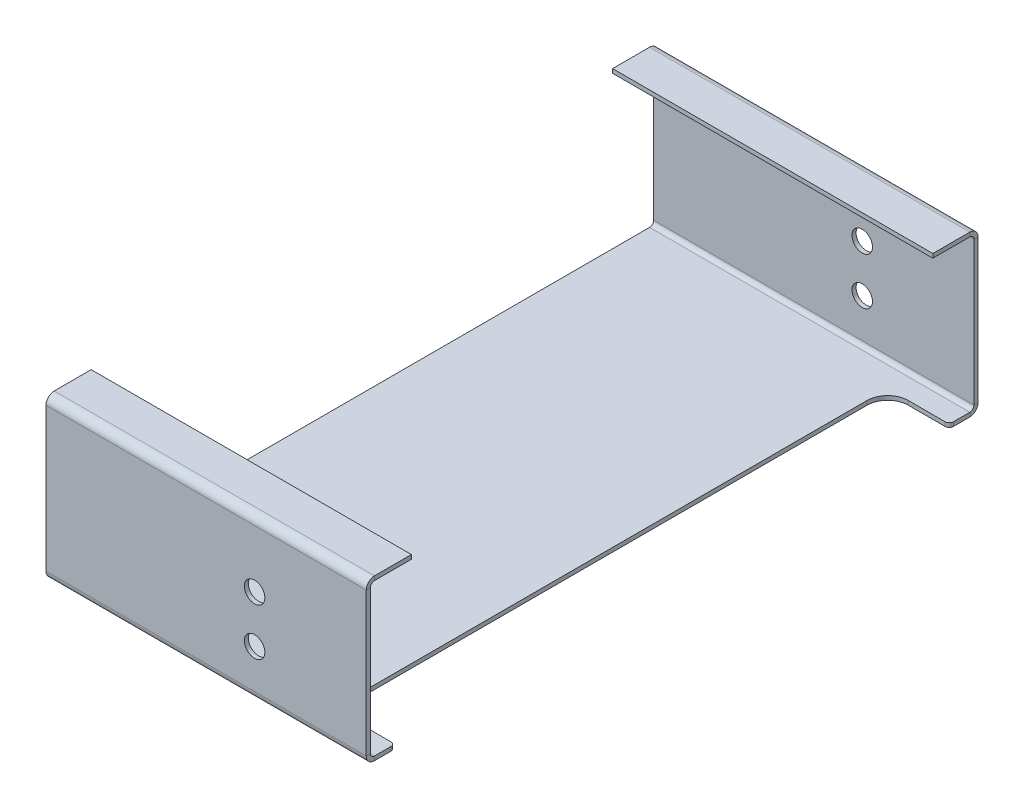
ISO-10303-21;
HEADER;
FILE_DESCRIPTION(('STEP AP214'),'2;1');
FILE_NAME('part.step','',(''),(''),'','','');
FILE_SCHEMA(('AUTOMOTIVE_DESIGN { 1 0 10303 214 1 1 1 1 }'));
ENDSEC;
DATA;
#1=APPLICATION_CONTEXT('core data for automotive mechanical design processes');
#2=APPLICATION_PROTOCOL_DEFINITION('international standard','automotive_design',2000,#1);
#3=PRODUCT_CONTEXT('',#1,'mechanical');
#4=PRODUCT('Part','Part','',(#3));
#5=PRODUCT_RELATED_PRODUCT_CATEGORY('part','',(#4));
#6=PRODUCT_DEFINITION_FORMATION('','',#4);
#7=PRODUCT_DEFINITION_CONTEXT('part definition',#1,'design');
#8=PRODUCT_DEFINITION('design','',#6,#7);
#9=PRODUCT_DEFINITION_SHAPE('','',#8);
#10=(LENGTH_UNIT() NAMED_UNIT(*) SI_UNIT(.MILLI.,.METRE.));
#11=(NAMED_UNIT(*) PLANE_ANGLE_UNIT() SI_UNIT($,.RADIAN.));
#12=(NAMED_UNIT(*) SI_UNIT($,.STERADIAN.) SOLID_ANGLE_UNIT());
#13=UNCERTAINTY_MEASURE_WITH_UNIT(LENGTH_MEASURE(1.E-05),#10,'distance_accuracy_value','');
#14=(GEOMETRIC_REPRESENTATION_CONTEXT(3) GLOBAL_UNCERTAINTY_ASSIGNED_CONTEXT((#13)) GLOBAL_UNIT_ASSIGNED_CONTEXT((#10,
#11,#12)) REPRESENTATION_CONTEXT('',''));
#15=CARTESIAN_POINT('',(0.,0.,0.));
#16=DIRECTION('',(0.,0.,1.));
#17=DIRECTION('',(1.,0.,0.));
#18=AXIS2_PLACEMENT_3D('',#15,#16,#17);
#19=CARTESIAN_POINT('',(0.,0.,147.));
#20=DIRECTION('',(1.,0.,0.));
#21=DIRECTION('',(0.,0.,-1.));
#22=AXIS2_PLACEMENT_3D('',#19,#20,#21);
#23=PLANE('',#22);
#24=DIRECTION('',(0.,0.,1.));
#25=VECTOR('',#24,1.);
#26=CARTESIAN_POINT('',(0.,-1.,147.));
#27=LINE('',#26,#25);
#28=CARTESIAN_POINT('',(0.,-1.,146.));
#29=VERTEX_POINT('',#28);
#30=CARTESIAN_POINT('',(0.,-1.,142.));
#31=VERTEX_POINT('',#30);
#32=EDGE_CURVE('E407',#29,#31,#27,.F.);
#33=ORIENTED_EDGE('',*,*,#32,.T.);
#34=DIRECTION('',(0.,1.,0.));
#35=VECTOR('',#34,1.);
#36=CARTESIAN_POINT('',(0.,0.,142.));
#37=LINE('',#36,#35);
#38=CARTESIAN_POINT('',(0.,0.,142.));
#39=VERTEX_POINT('',#38);
#40=EDGE_CURVE('E518',#31,#39,#37,.T.);
#41=ORIENTED_EDGE('',*,*,#40,.T.);
#42=DIRECTION('',(0.,0.,-1.));
#43=VECTOR('',#42,1.);
#44=CARTESIAN_POINT('',(0.,0.,147.));
#45=LINE('',#44,#43);
#46=CARTESIAN_POINT('',(0.,0.,146.));
#47=VERTEX_POINT('',#46);
#48=EDGE_CURVE('E436',#47,#39,#45,.T.);
#49=ORIENTED_EDGE('',*,*,#48,.F.);
#50=DIRECTION('',(0.,-1.,0.));
#51=VECTOR('',#50,1.);
#52=CARTESIAN_POINT('',(0.,0.,146.));
#53=LINE('',#52,#51);
#54=EDGE_CURVE('E492',#47,#29,#53,.T.);
#55=ORIENTED_EDGE('',*,*,#54,.T.);
#56=EDGE_LOOP('',(#33,#41,#49,#55));
#57=FACE_BOUND('',#56,.T.);
#58=ADVANCED_FACE('F86',(#57),#23,.T.);
#59=CARTESIAN_POINT('',(0.,0.,4.99999999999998));
#60=VERTEX_POINT('',#59);
#61=CARTESIAN_POINT('',(0.,0.,1.));
#62=VERTEX_POINT('',#61);
#63=EDGE_CURVE('E435',#60,#62,#45,.T.);
#64=ORIENTED_EDGE('',*,*,#63,.F.);
#65=DIRECTION('',(0.,1.,0.));
#66=VECTOR('',#65,1.);
#67=CARTESIAN_POINT('',(0.,-1.,4.99999999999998));
#68=LINE('',#67,#66);
#69=CARTESIAN_POINT('',(0.,-1.,4.99999999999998));
#70=VERTEX_POINT('',#69);
#71=EDGE_CURVE('E15',#60,#70,#68,.F.);
#72=ORIENTED_EDGE('',*,*,#71,.T.);
#73=CARTESIAN_POINT('',(0.,-1.,1.));
#74=VERTEX_POINT('',#73);
#75=EDGE_CURVE('E415',#70,#74,#27,.F.);
#76=ORIENTED_EDGE('',*,*,#75,.T.);
#77=DIRECTION('',(0.,-1.,0.));
#78=VECTOR('',#77,1.);
#79=CARTESIAN_POINT('',(0.,0.,1.));
#80=LINE('',#79,#78);
#81=EDGE_CURVE('E494',#62,#74,#80,.T.);
#82=ORIENTED_EDGE('',*,*,#81,.F.);
#83=EDGE_LOOP('',(#64,#72,#76,#82));
#84=FACE_BOUND('',#83,.T.);
#85=ADVANCED_FACE('F630',(#84),#23,.T.);
#86=CARTESIAN_POINT('',(0.,1.,146.));
#87=DIRECTION('',(1.,0.,0.));
#88=DIRECTION('',(0.,0.,-1.));
#89=AXIS2_PLACEMENT_3D('',#86,#87,#88);
#90=PLANE('',#89);
#91=ORIENTED_EDGE('',*,*,#54,.F.);
#92=CARTESIAN_POINT('',(0.,1.,146.));
#93=DIRECTION('',(-1.,0.,0.));
#94=DIRECTION('',(0.,0.,1.));
#95=AXIS2_PLACEMENT_3D('',#92,#93,#94);
#96=CIRCLE('',#95,1.);
#97=CARTESIAN_POINT('',(0.,1.,147.));
#98=VERTEX_POINT('',#97);
#99=EDGE_CURVE('E368',#47,#98,#96,.T.);
#100=ORIENTED_EDGE('',*,*,#99,.T.);
#101=DIRECTION('',(0.,0.,1.));
#102=VECTOR('',#101,1.);
#103=CARTESIAN_POINT('',(0.,1.,147.));
#104=LINE('',#103,#102);
#105=CARTESIAN_POINT('',(0.,1.,148.));
#106=VERTEX_POINT('',#105);
#107=EDGE_CURVE('E490',#98,#106,#104,.T.);
#108=ORIENTED_EDGE('',*,*,#107,.T.);
#109=CARTESIAN_POINT('',(0.,1.,146.));
#110=DIRECTION('',(-1.,0.,0.));
#111=DIRECTION('',(0.,0.,1.));
#112=AXIS2_PLACEMENT_3D('',#109,#110,#111);
#113=CIRCLE('',#112,2.);
#114=EDGE_CURVE('E411',#29,#106,#113,.T.);
#115=ORIENTED_EDGE('',*,*,#114,.F.);
#116=EDGE_LOOP('',(#91,#100,#108,#115));
#117=FACE_BOUND('',#116,.T.);
#118=ADVANCED_FACE('F610',(#117),#90,.T.);
#119=CARTESIAN_POINT('',(0.,0.,147.));
#120=DIRECTION('',(1.,0.,0.));
#121=DIRECTION('',(0.,1.,0.));
#122=AXIS2_PLACEMENT_3D('',#119,#120,#121);
#123=PLANE('',#122);
#124=ORIENTED_EDGE('',*,*,#107,.F.);
#125=DIRECTION('',(0.,1.,0.));
#126=VECTOR('',#125,1.);
#127=CARTESIAN_POINT('',(0.,0.,147.));
#128=LINE('',#127,#126);
#129=CARTESIAN_POINT('',(0.,36.,147.));
#130=VERTEX_POINT('',#129);
#131=EDGE_CURVE('E426',#98,#130,#128,.T.);
#132=ORIENTED_EDGE('',*,*,#131,.T.);
#133=DIRECTION('',(0.,0.,1.));
#134=VECTOR('',#133,1.);
#135=CARTESIAN_POINT('',(0.,36.,147.));
#136=LINE('',#135,#134);
#137=CARTESIAN_POINT('',(0.,36.,148.));
#138=VERTEX_POINT('',#137);
#139=EDGE_CURVE('E488',#130,#138,#136,.T.);
#140=ORIENTED_EDGE('',*,*,#139,.T.);
#141=DIRECTION('',(0.,1.,0.));
#142=VECTOR('',#141,1.);
#143=CARTESIAN_POINT('',(0.,0.,148.));
#144=LINE('',#143,#142);
#145=EDGE_CURVE('E403',#106,#138,#144,.T.);
#146=ORIENTED_EDGE('',*,*,#145,.F.);
#147=EDGE_LOOP('',(#124,#132,#140,#146));
#148=FACE_BOUND('',#147,.T.);
#149=ADVANCED_FACE('F587',(#148),#123,.T.);
#150=CARTESIAN_POINT('',(-78.,36.,147.));
#151=DIRECTION('',(-1.,0.,0.));
#152=DIRECTION('',(0.,-1.,0.));
#153=AXIS2_PLACEMENT_3D('',#150,#151,#152);
#154=PLANE('',#153);
#155=DIRECTION('',(0.,0.,1.));
#156=VECTOR('',#155,1.);
#157=CARTESIAN_POINT('',(-78.,36.,147.));
#158=LINE('',#157,#156);
#159=CARTESIAN_POINT('',(-78.,36.,147.));
#160=VERTEX_POINT('',#159);
#161=CARTESIAN_POINT('',(-78.,36.,148.));
#162=VERTEX_POINT('',#161);
#163=EDGE_CURVE('E485',#160,#162,#158,.T.);
#164=ORIENTED_EDGE('',*,*,#163,.F.);
#165=DIRECTION('',(0.,-1.,0.));
#166=VECTOR('',#165,1.);
#167=CARTESIAN_POINT('',(-78.,36.,147.));
#168=LINE('',#167,#166);
#169=CARTESIAN_POINT('',(-78.,1.,147.));
#170=VERTEX_POINT('',#169);
#171=EDGE_CURVE('E432',#160,#170,#168,.T.);
#172=ORIENTED_EDGE('',*,*,#171,.T.);
#173=DIRECTION('',(0.,0.,1.));
#174=VECTOR('',#173,1.);
#175=CARTESIAN_POINT('',(-78.,1.,147.));
#176=LINE('',#175,#174);
#177=CARTESIAN_POINT('',(-78.,1.,148.));
#178=VERTEX_POINT('',#177);
#179=EDGE_CURVE('E483',#170,#178,#176,.T.);
#180=ORIENTED_EDGE('',*,*,#179,.T.);
#181=DIRECTION('',(0.,1.,0.));
#182=VECTOR('',#181,1.);
#183=CARTESIAN_POINT('',(-78.,0.,148.));
#184=LINE('',#183,#182);
#185=EDGE_CURVE('E412',#162,#178,#184,.F.);
#186=ORIENTED_EDGE('',*,*,#185,.F.);
#187=EDGE_LOOP('',(#164,#172,#180,#186));
#188=FACE_BOUND('',#187,.T.);
#189=ADVANCED_FACE('F600',(#188),#154,.T.);
#190=CARTESIAN_POINT('',(-78.,1.,146.));
#191=DIRECTION('',(1.,0.,0.));
#192=DIRECTION('',(0.,0.,-1.));
#193=AXIS2_PLACEMENT_3D('',#190,#191,#192);
#194=PLANE('',#193);
#195=ORIENTED_EDGE('',*,*,#179,.F.);
#196=CARTESIAN_POINT('',(-78.,1.,146.));
#197=DIRECTION('',(-1.,0.,0.));
#198=DIRECTION('',(0.,0.,1.));
#199=AXIS2_PLACEMENT_3D('',#196,#197,#198);
#200=CIRCLE('',#199,1.);
#201=CARTESIAN_POINT('',(-78.,0.,146.));
#202=VERTEX_POINT('',#201);
#203=EDGE_CURVE('E460',#170,#202,#200,.F.);
#204=ORIENTED_EDGE('',*,*,#203,.T.);
#205=DIRECTION('',(0.,-1.,0.));
#206=VECTOR('',#205,1.);
#207=CARTESIAN_POINT('',(-78.,0.,146.));
#208=LINE('',#207,#206);
#209=CARTESIAN_POINT('',(-78.,-1.,146.));
#210=VERTEX_POINT('',#209);
#211=EDGE_CURVE('E481',#202,#210,#208,.T.);
#212=ORIENTED_EDGE('',*,*,#211,.T.);
#213=CARTESIAN_POINT('',(-78.,1.,146.));
#214=DIRECTION('',(-1.,0.,0.));
#215=DIRECTION('',(0.,0.,1.));
#216=AXIS2_PLACEMENT_3D('',#213,#214,#215);
#217=CIRCLE('',#216,2.);
#218=EDGE_CURVE('E408',#178,#210,#217,.F.);
#219=ORIENTED_EDGE('',*,*,#218,.F.);
#220=EDGE_LOOP('',(#195,#204,#212,#219));
#221=FACE_BOUND('',#220,.T.);
#222=ADVANCED_FACE('F619',(#221),#194,.F.);
#223=CARTESIAN_POINT('',(-78.,0.,147.));
#224=DIRECTION('',(1.,0.,0.));
#225=DIRECTION('',(0.,0.,-1.));
#226=AXIS2_PLACEMENT_3D('',#223,#224,#225);
#227=PLANE('',#226);
#228=ORIENTED_EDGE('',*,*,#211,.F.);
#229=DIRECTION('',(0.,0.,-1.));
#230=VECTOR('',#229,1.);
#231=CARTESIAN_POINT('',(-78.,0.,147.));
#232=LINE('',#231,#230);
#233=CARTESIAN_POINT('',(-78.,0.,1.));
#234=VERTEX_POINT('',#233);
#235=EDGE_CURVE('E439',#202,#234,#232,.T.);
#236=ORIENTED_EDGE('',*,*,#235,.T.);
#237=DIRECTION('',(0.,-1.,0.));
#238=VECTOR('',#237,1.);
#239=CARTESIAN_POINT('',(-78.,0.,1.));
#240=LINE('',#239,#238);
#241=CARTESIAN_POINT('',(-78.,-1.,1.));
#242=VERTEX_POINT('',#241);
#243=EDGE_CURVE('E479',#234,#242,#240,.T.);
#244=ORIENTED_EDGE('',*,*,#243,.T.);
#245=DIRECTION('',(0.,0.,1.));
#246=VECTOR('',#245,1.);
#247=CARTESIAN_POINT('',(-78.,-1.,147.));
#248=LINE('',#247,#246);
#249=EDGE_CURVE('E399',#210,#242,#248,.F.);
#250=ORIENTED_EDGE('',*,*,#249,.F.);
#251=EDGE_LOOP('',(#228,#236,#244,#250));
#252=FACE_BOUND('',#251,.T.);
#253=ADVANCED_FACE('F618',(#252),#227,.F.);
#254=CARTESIAN_POINT('',(-78.,1.,1.));
#255=DIRECTION('',(-1.,0.,0.));
#256=DIRECTION('',(0.,0.,1.));
#257=AXIS2_PLACEMENT_3D('',#254,#255,#256);
#258=PLANE('',#257);
#259=ORIENTED_EDGE('',*,*,#243,.F.);
#260=CARTESIAN_POINT('',(-78.,1.,1.));
#261=DIRECTION('',(1.,0.,0.));
#262=DIRECTION('',(0.,0.,-1.));
#263=AXIS2_PLACEMENT_3D('',#260,#261,#262);
#264=CIRCLE('',#263,1.);
#265=CARTESIAN_POINT('',(-78.,1.,0.));
#266=VERTEX_POINT('',#265);
#267=EDGE_CURVE('E430',#234,#266,#264,.T.);
#268=ORIENTED_EDGE('',*,*,#267,.T.);
#269=DIRECTION('',(0.,0.,-1.));
#270=VECTOR('',#269,1.);
#271=CARTESIAN_POINT('',(-78.,1.,0.));
#272=LINE('',#271,#270);
#273=CARTESIAN_POINT('',(-78.,1.,-0.999999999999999));
#274=VERTEX_POINT('',#273);
#275=EDGE_CURVE('E477',#266,#274,#272,.T.);
#276=ORIENTED_EDGE('',*,*,#275,.T.);
#277=CARTESIAN_POINT('',(-78.,1.,1.));
#278=DIRECTION('',(1.,0.,0.));
#279=DIRECTION('',(0.,0.,-1.));
#280=AXIS2_PLACEMENT_3D('',#277,#278,#279);
#281=CIRCLE('',#280,2.);
#282=EDGE_CURVE('E400',#242,#274,#281,.T.);
#283=ORIENTED_EDGE('',*,*,#282,.F.);
#284=EDGE_LOOP('',(#259,#268,#276,#283));
#285=FACE_BOUND('',#284,.T.);
#286=ADVANCED_FACE('F626',(#285),#258,.T.);
#287=CARTESIAN_POINT('',(-78.,36.,0.));
#288=DIRECTION('',(-1.,0.,0.));
#289=DIRECTION('',(0.,-1.,0.));
#290=AXIS2_PLACEMENT_3D('',#287,#288,#289);
#291=PLANE('',#290);
#292=ORIENTED_EDGE('',*,*,#275,.F.);
#293=DIRECTION('',(0.,-1.,0.));
#294=VECTOR('',#293,1.);
#295=CARTESIAN_POINT('',(-78.,36.,0.));
#296=LINE('',#295,#294);
#297=CARTESIAN_POINT('',(-78.,36.,0.));
#298=VERTEX_POINT('',#297);
#299=EDGE_CURVE('E442',#298,#266,#296,.T.);
#300=ORIENTED_EDGE('',*,*,#299,.F.);
#301=DIRECTION('',(0.,0.,-1.));
#302=VECTOR('',#301,1.);
#303=CARTESIAN_POINT('',(-78.,36.,0.));
#304=LINE('',#303,#302);
#305=CARTESIAN_POINT('',(-78.,36.,-0.999999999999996));
#306=VERTEX_POINT('',#305);
#307=EDGE_CURVE('E474',#298,#306,#304,.T.);
#308=ORIENTED_EDGE('',*,*,#307,.T.);
#309=DIRECTION('',(0.,1.,0.));
#310=VECTOR('',#309,1.);
#311=CARTESIAN_POINT('',(-78.,0.,-1.));
#312=LINE('',#311,#310);
#313=EDGE_CURVE('E396',#306,#274,#312,.F.);
#314=ORIENTED_EDGE('',*,*,#313,.T.);
#315=EDGE_LOOP('',(#292,#300,#308,#314));
#316=FACE_BOUND('',#315,.T.);
#317=ADVANCED_FACE('F774',(#316),#291,.T.);
#318=CARTESIAN_POINT('',(0.,0.,0.));
#319=DIRECTION('',(1.,0.,0.));
#320=DIRECTION('',(0.,1.,0.));
#321=AXIS2_PLACEMENT_3D('',#318,#319,#320);
#322=PLANE('',#321);
#323=DIRECTION('',(0.,0.,-1.));
#324=VECTOR('',#323,1.);
#325=CARTESIAN_POINT('',(0.,36.,0.));
#326=LINE('',#325,#324);
#327=CARTESIAN_POINT('',(0.,36.,0.));
#328=VERTEX_POINT('',#327);
#329=CARTESIAN_POINT('',(0.,36.,-1.));
#330=VERTEX_POINT('',#329);
#331=EDGE_CURVE('E471',#328,#330,#326,.T.);
#332=ORIENTED_EDGE('',*,*,#331,.F.);
#333=DIRECTION('',(0.,1.,0.));
#334=VECTOR('',#333,1.);
#335=CARTESIAN_POINT('',(0.,0.,0.));
#336=LINE('',#335,#334);
#337=CARTESIAN_POINT('',(0.,1.,0.));
#338=VERTEX_POINT('',#337);
#339=EDGE_CURVE('E447',#338,#328,#336,.T.);
#340=ORIENTED_EDGE('',*,*,#339,.F.);
#341=DIRECTION('',(0.,0.,-1.));
#342=VECTOR('',#341,1.);
#343=CARTESIAN_POINT('',(0.,1.,0.));
#344=LINE('',#343,#342);
#345=CARTESIAN_POINT('',(0.,1.,-1.));
#346=VERTEX_POINT('',#345);
#347=EDGE_CURVE('E388',#338,#346,#344,.T.);
#348=ORIENTED_EDGE('',*,*,#347,.T.);
#349=DIRECTION('',(0.,1.,0.));
#350=VECTOR('',#349,1.);
#351=CARTESIAN_POINT('',(0.,0.,-1.));
#352=LINE('',#351,#350);
#353=EDGE_CURVE('E384',#346,#330,#352,.T.);
#354=ORIENTED_EDGE('',*,*,#353,.T.);
#355=EDGE_LOOP('',(#332,#340,#348,#354));
#356=FACE_BOUND('',#355,.T.);
#357=ADVANCED_FACE('F642',(#356),#322,.T.);
#358=CARTESIAN_POINT('',(0.,1.,1.));
#359=DIRECTION('',(-1.,0.,0.));
#360=DIRECTION('',(0.,0.,1.));
#361=AXIS2_PLACEMENT_3D('',#358,#359,#360);
#362=PLANE('',#361);
#363=CARTESIAN_POINT('',(0.,1.,1.));
#364=DIRECTION('',(1.,0.,0.));
#365=DIRECTION('',(0.,0.,-1.));
#366=AXIS2_PLACEMENT_3D('',#363,#364,#365);
#367=CIRCLE('',#366,1.);
#368=EDGE_CURVE('E457',#338,#62,#367,.F.);
#369=ORIENTED_EDGE('',*,*,#368,.T.);
#370=ORIENTED_EDGE('',*,*,#81,.T.);
#371=CARTESIAN_POINT('',(0.,1.,1.));
#372=DIRECTION('',(1.,0.,0.));
#373=DIRECTION('',(0.,0.,-1.));
#374=AXIS2_PLACEMENT_3D('',#371,#372,#373);
#375=CIRCLE('',#374,2.);
#376=EDGE_CURVE('E404',#346,#74,#375,.F.);
#377=ORIENTED_EDGE('',*,*,#376,.F.);
#378=ORIENTED_EDGE('',*,*,#347,.F.);
#379=EDGE_LOOP('',(#369,#370,#377,#378));
#380=FACE_BOUND('',#379,.T.);
#381=ADVANCED_FACE('F638',(#380),#362,.F.);
#382=CARTESIAN_POINT('',(0.,0.,-1.));
#383=DIRECTION('',(0.,0.,1.));
#384=DIRECTION('',(1.,0.,0.));
#385=AXIS2_PLACEMENT_3D('',#382,#383,#384);
#386=PLANE('',#385);
#387=CARTESIAN_POINT('',(-27.2,22.,-1.));
#388=DIRECTION('',(0.,0.,-1.));
#389=DIRECTION('',(-1.,0.,0.));
#390=AXIS2_PLACEMENT_3D('',#387,#388,#389);
#391=CIRCLE('',#390,2.5);
#392=CARTESIAN_POINT('',(-29.7,22.,-1.));
#393=VERTEX_POINT('',#392);
#394=EDGE_CURVE('E1218',#393,#393,#391,.T.);
#395=ORIENTED_EDGE('',*,*,#394,.F.);
#396=EDGE_LOOP('',(#395));
#397=FACE_BOUND('',#396,.T.);
#398=CARTESIAN_POINT('',(-27.2,10.5,-1.));
#399=DIRECTION('',(0.,0.,-1.));
#400=DIRECTION('',(-1.,0.,0.));
#401=AXIS2_PLACEMENT_3D('',#398,#399,#400);
#402=CIRCLE('',#401,2.49999999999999);
#403=CARTESIAN_POINT('',(-29.7,10.5,-1.));
#404=VERTEX_POINT('',#403);
#405=EDGE_CURVE('E541',#404,#404,#402,.T.);
#406=ORIENTED_EDGE('',*,*,#405,.F.);
#407=EDGE_LOOP('',(#406));
#408=FACE_BOUND('',#407,.T.);
#409=ORIENTED_EDGE('',*,*,#353,.F.);
#410=DIRECTION('',(1.,0.,0.));
#411=VECTOR('',#410,1.);
#412=CARTESIAN_POINT('',(0.,1.,-1.));
#413=LINE('',#412,#411);
#414=EDGE_CURVE('E377',#346,#274,#413,.F.);
#415=ORIENTED_EDGE('',*,*,#414,.T.);
#416=ORIENTED_EDGE('',*,*,#313,.F.);
#417=DIRECTION('',(1.,0.,0.));
#418=VECTOR('',#417,1.);
#419=CARTESIAN_POINT('',(0.,36.,-1.));
#420=LINE('',#419,#418);
#421=EDGE_CURVE('E393',#330,#306,#420,.F.);
#422=ORIENTED_EDGE('',*,*,#421,.F.);
#423=EDGE_LOOP('',(#409,#415,#416,#422));
#424=FACE_BOUND('',#423,.T.);
#425=ADVANCED_FACE('F641',(#397,#408,#424),#386,.F.);
#426=CARTESIAN_POINT('',(-78.,-1.,147.));
#427=DIRECTION('',(0.,1.,0.));
#428=DIRECTION('',(0.,0.,1.));
#429=AXIS2_PLACEMENT_3D('',#426,#427,#428);
#430=PLANE('',#429);
#431=DIRECTION('',(1.,0.,0.));
#432=VECTOR('',#431,1.);
#433=CARTESIAN_POINT('',(0.,-1.,141.));
#434=LINE('',#433,#432);
#435=CARTESIAN_POINT('',(-10.,-1.,141.));
#436=VERTEX_POINT('',#435);
#437=CARTESIAN_POINT('',(-1.,-1.,141.));
#438=VERTEX_POINT('',#437);
#439=EDGE_CURVE('E327',#436,#438,#434,.T.);
#440=ORIENTED_EDGE('',*,*,#439,.T.);
#441=CARTESIAN_POINT('',(-1.,-1.,142.));
#442=DIRECTION('',(0.,1.,0.));
#443=DIRECTION('',(0.,0.,1.));
#444=AXIS2_PLACEMENT_3D('',#441,#442,#443);
#445=CIRCLE('',#444,1.);
#446=EDGE_CURVE('E528',#438,#31,#445,.F.);
#447=ORIENTED_EDGE('',*,*,#446,.T.);
#448=ORIENTED_EDGE('',*,*,#32,.F.);
#449=DIRECTION('',(1.,0.,0.));
#450=VECTOR('',#449,1.);
#451=CARTESIAN_POINT('',(-78.,-1.,146.));
#452=LINE('',#451,#450);
#453=EDGE_CURVE('E385',#29,#210,#452,.F.);
#454=ORIENTED_EDGE('',*,*,#453,.T.);
#455=ORIENTED_EDGE('',*,*,#249,.T.);
#456=DIRECTION('',(1.,0.,0.));
#457=VECTOR('',#456,1.);
#458=CARTESIAN_POINT('',(-78.,-1.,1.));
#459=LINE('',#458,#457);
#460=EDGE_CURVE('E381',#242,#74,#459,.T.);
#461=ORIENTED_EDGE('',*,*,#460,.T.);
#462=ORIENTED_EDGE('',*,*,#75,.F.);
#463=CARTESIAN_POINT('',(-1.,-1.,4.99999999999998));
#464=DIRECTION('',(0.,1.,0.));
#465=DIRECTION('',(0.,0.,1.));
#466=AXIS2_PLACEMENT_3D('',#463,#464,#465);
#467=CIRCLE('',#466,1.);
#468=CARTESIAN_POINT('',(-1.,-1.,5.99999999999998));
#469=VERTEX_POINT('',#468);
#470=EDGE_CURVE('E108',#70,#469,#467,.F.);
#471=ORIENTED_EDGE('',*,*,#470,.T.);
#472=DIRECTION('',(-1.,0.,0.));
#473=VECTOR('',#472,1.);
#474=CARTESIAN_POINT('',(0.,-1.,5.99999999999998));
#475=LINE('',#474,#473);
#476=CARTESIAN_POINT('',(-10.,-1.,5.99999999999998));
#477=VERTEX_POINT('',#476);
#478=EDGE_CURVE('E551',#469,#477,#475,.T.);
#479=ORIENTED_EDGE('',*,*,#478,.T.);
#480=CARTESIAN_POINT('',(-10.,-1.,11.));
#481=DIRECTION('',(0.,1.,0.));
#482=DIRECTION('',(0.,0.,1.));
#483=AXIS2_PLACEMENT_3D('',#480,#481,#482);
#484=CIRCLE('',#483,5.);
#485=CARTESIAN_POINT('',(-15.,-1.,11.));
#486=VERTEX_POINT('',#485);
#487=EDGE_CURVE('E516',#477,#486,#484,.T.);
#488=ORIENTED_EDGE('',*,*,#487,.T.);
#489=DIRECTION('',(0.,0.,1.));
#490=VECTOR('',#489,1.);
#491=CARTESIAN_POINT('',(-15.,-1.,5.99999999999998));
#492=LINE('',#491,#490);
#493=CARTESIAN_POINT('',(-15.,-1.,136.));
#494=VERTEX_POINT('',#493);
#495=EDGE_CURVE('E553',#486,#494,#492,.T.);
#496=ORIENTED_EDGE('',*,*,#495,.T.);
#497=CARTESIAN_POINT('',(-10.,-1.,136.));
#498=DIRECTION('',(0.,1.,0.));
#499=DIRECTION('',(0.,0.,1.));
#500=AXIS2_PLACEMENT_3D('',#497,#498,#499);
#501=CIRCLE('',#500,5.);
#502=EDGE_CURVE('E511',#494,#436,#501,.T.);
#503=ORIENTED_EDGE('',*,*,#502,.T.);
#504=EDGE_LOOP('',(#440,#447,#448,#454,#455,#461,#462,#471,#479,#488,#496,#503));
#505=FACE_BOUND('',#504,.T.);
#506=ADVANCED_FACE('F663',(#505),#430,.F.);
#507=CARTESIAN_POINT('',(0.,0.,148.));
#508=DIRECTION('',(0.,0.,1.));
#509=DIRECTION('',(1.,0.,0.));
#510=AXIS2_PLACEMENT_3D('',#507,#508,#509);
#511=PLANE('',#510);
#512=CARTESIAN_POINT('',(-27.2,22.,148.));
#513=DIRECTION('',(0.,0.,-1.));
#514=DIRECTION('',(-1.,0.,0.));
#515=AXIS2_PLACEMENT_3D('',#512,#513,#514);
#516=CIRCLE('',#515,2.5);
#517=CARTESIAN_POINT('',(-29.7,22.,148.));
#518=VERTEX_POINT('',#517);
#519=EDGE_CURVE('E1219',#518,#518,#516,.T.);
#520=ORIENTED_EDGE('',*,*,#519,.T.);
#521=EDGE_LOOP('',(#520));
#522=FACE_BOUND('',#521,.T.);
#523=CARTESIAN_POINT('',(-27.2,10.5,148.));
#524=DIRECTION('',(0.,0.,-1.));
#525=DIRECTION('',(-1.,0.,0.));
#526=AXIS2_PLACEMENT_3D('',#523,#524,#525);
#527=CIRCLE('',#526,2.49999999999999);
#528=CARTESIAN_POINT('',(-29.7,10.5,148.));
#529=VERTEX_POINT('',#528);
#530=EDGE_CURVE('E534',#529,#529,#527,.T.);
#531=ORIENTED_EDGE('',*,*,#530,.T.);
#532=EDGE_LOOP('',(#531));
#533=FACE_BOUND('',#532,.T.);
#534=ORIENTED_EDGE('',*,*,#185,.T.);
#535=DIRECTION('',(1.,0.,0.));
#536=VECTOR('',#535,1.);
#537=CARTESIAN_POINT('',(0.,1.,148.));
#538=LINE('',#537,#536);
#539=EDGE_CURVE('E380',#178,#106,#538,.T.);
#540=ORIENTED_EDGE('',*,*,#539,.T.);
#541=ORIENTED_EDGE('',*,*,#145,.T.);
#542=DIRECTION('',(1.,0.,0.));
#543=VECTOR('',#542,1.);
#544=CARTESIAN_POINT('',(0.,36.,148.));
#545=LINE('',#544,#543);
#546=EDGE_CURVE('E278',#138,#162,#545,.F.);
#547=ORIENTED_EDGE('',*,*,#546,.T.);
#548=EDGE_LOOP('',(#534,#540,#541,#547));
#549=FACE_BOUND('',#548,.T.);
#550=ADVANCED_FACE('F603',(#522,#533,#549),#511,.T.);
#551=CARTESIAN_POINT('',(-78.,1.,1.));
#552=DIRECTION('',(1.,0.,0.));
#553=DIRECTION('',(0.,0.,-1.));
#554=AXIS2_PLACEMENT_3D('',#551,#552,#553);
#555=CYLINDRICAL_SURFACE('',#554,2.);
#556=ORIENTED_EDGE('',*,*,#282,.T.);
#557=ORIENTED_EDGE('',*,*,#414,.F.);
#558=ORIENTED_EDGE('',*,*,#376,.T.);
#559=ORIENTED_EDGE('',*,*,#460,.F.);
#560=EDGE_LOOP('',(#556,#557,#558,#559));
#561=FACE_BOUND('',#560,.T.);
#562=ADVANCED_FACE('F750',(#561),#555,.T.);
#563=CARTESIAN_POINT('',(0.,1.,146.));
#564=DIRECTION('',(-1.,0.,0.));
#565=DIRECTION('',(0.,0.,1.));
#566=AXIS2_PLACEMENT_3D('',#563,#564,#565);
#567=CYLINDRICAL_SURFACE('',#566,2.);
#568=ORIENTED_EDGE('',*,*,#218,.T.);
#569=ORIENTED_EDGE('',*,*,#453,.F.);
#570=ORIENTED_EDGE('',*,*,#114,.T.);
#571=ORIENTED_EDGE('',*,*,#539,.F.);
#572=EDGE_LOOP('',(#568,#569,#570,#571));
#573=FACE_BOUND('',#572,.T.);
#574=ADVANCED_FACE('F607',(#573),#567,.T.);
#575=CARTESIAN_POINT('',(0.,0.,0.));
#576=DIRECTION('',(0.,0.,1.));
#577=DIRECTION('',(1.,0.,0.));
#578=AXIS2_PLACEMENT_3D('',#575,#576,#577);
#579=PLANE('',#578);
#580=CARTESIAN_POINT('',(-27.2,22.,0.));
#581=DIRECTION('',(0.,0.,1.));
#582=DIRECTION('',(1.,0.,0.));
#583=AXIS2_PLACEMENT_3D('',#580,#581,#582);
#584=CIRCLE('',#583,2.5);
#585=CARTESIAN_POINT('',(-24.7,22.,0.));
#586=VERTEX_POINT('',#585);
#587=EDGE_CURVE('E546',#586,#586,#584,.T.);
#588=ORIENTED_EDGE('',*,*,#587,.F.);
#589=EDGE_LOOP('',(#588));
#590=FACE_BOUND('',#589,.T.);
#591=CARTESIAN_POINT('',(-27.2,10.5,0.));
#592=DIRECTION('',(0.,0.,1.));
#593=DIRECTION('',(1.,0.,0.));
#594=AXIS2_PLACEMENT_3D('',#591,#592,#593);
#595=CIRCLE('',#594,2.49999999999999);
#596=CARTESIAN_POINT('',(-24.7,10.5,0.));
#597=VERTEX_POINT('',#596);
#598=EDGE_CURVE('E533',#597,#597,#595,.T.);
#599=ORIENTED_EDGE('',*,*,#598,.F.);
#600=EDGE_LOOP('',(#599));
#601=FACE_BOUND('',#600,.T.);
#602=ORIENTED_EDGE('',*,*,#339,.T.);
#603=DIRECTION('',(-1.,0.,0.));
#604=VECTOR('',#603,1.);
#605=CARTESIAN_POINT('',(0.,36.,0.));
#606=LINE('',#605,#604);
#607=EDGE_CURVE('E445',#328,#298,#606,.T.);
#608=ORIENTED_EDGE('',*,*,#607,.T.);
#609=ORIENTED_EDGE('',*,*,#299,.T.);
#610=DIRECTION('',(1.,0.,0.));
#611=VECTOR('',#610,1.);
#612=CARTESIAN_POINT('',(0.,1.,0.));
#613=LINE('',#612,#611);
#614=EDGE_CURVE('E453',#338,#266,#613,.F.);
#615=ORIENTED_EDGE('',*,*,#614,.F.);
#616=EDGE_LOOP('',(#602,#608,#609,#615));
#617=FACE_BOUND('',#616,.T.);
#618=ADVANCED_FACE('F757',(#590,#601,#617),#579,.T.);
#619=CARTESIAN_POINT('',(-78.,0.,147.));
#620=DIRECTION('',(0.,1.,0.));
#621=DIRECTION('',(0.,0.,1.));
#622=AXIS2_PLACEMENT_3D('',#619,#620,#621);
#623=PLANE('',#622);
#624=ORIENTED_EDGE('',*,*,#48,.T.);
#625=CARTESIAN_POINT('',(-1.,0.,142.));
#626=DIRECTION('',(0.,1.,0.));
#627=DIRECTION('',(0.,0.,1.));
#628=AXIS2_PLACEMENT_3D('',#625,#626,#627);
#629=CIRCLE('',#628,1.);
#630=CARTESIAN_POINT('',(-1.,0.,141.));
#631=VERTEX_POINT('',#630);
#632=EDGE_CURVE('E523',#39,#631,#629,.T.);
#633=ORIENTED_EDGE('',*,*,#632,.T.);
#634=DIRECTION('',(1.,0.,0.));
#635=VECTOR('',#634,1.);
#636=CARTESIAN_POINT('',(0.,0.,141.));
#637=LINE('',#636,#635);
#638=CARTESIAN_POINT('',(-10.,0.,141.));
#639=VERTEX_POINT('',#638);
#640=EDGE_CURVE('E554',#639,#631,#637,.T.);
#641=ORIENTED_EDGE('',*,*,#640,.F.);
#642=CARTESIAN_POINT('',(-10.,0.,136.));
#643=DIRECTION('',(0.,1.,0.));
#644=DIRECTION('',(0.,0.,1.));
#645=AXIS2_PLACEMENT_3D('',#642,#643,#644);
#646=CIRCLE('',#645,5.);
#647=CARTESIAN_POINT('',(-15.,0.,136.));
#648=VERTEX_POINT('',#647);
#649=EDGE_CURVE('E509',#639,#648,#646,.F.);
#650=ORIENTED_EDGE('',*,*,#649,.T.);
#651=DIRECTION('',(0.,0.,1.));
#652=VECTOR('',#651,1.);
#653=CARTESIAN_POINT('',(-15.,0.,5.99999999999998));
#654=LINE('',#653,#652);
#655=CARTESIAN_POINT('',(-15.,0.,11.));
#656=VERTEX_POINT('',#655);
#657=EDGE_CURVE('E560',#656,#648,#654,.T.);
#658=ORIENTED_EDGE('',*,*,#657,.F.);
#659=CARTESIAN_POINT('',(-10.,0.,11.));
#660=DIRECTION('',(0.,1.,0.));
#661=DIRECTION('',(0.,0.,1.));
#662=AXIS2_PLACEMENT_3D('',#659,#660,#661);
#663=CIRCLE('',#662,5.);
#664=CARTESIAN_POINT('',(-10.,0.,5.99999999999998));
#665=VERTEX_POINT('',#664);
#666=EDGE_CURVE('E513',#656,#665,#663,.F.);
#667=ORIENTED_EDGE('',*,*,#666,.T.);
#668=DIRECTION('',(-1.,0.,0.));
#669=VECTOR('',#668,1.);
#670=CARTESIAN_POINT('',(0.,0.,5.99999999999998));
#671=LINE('',#670,#669);
#672=CARTESIAN_POINT('',(-1.,0.,5.99999999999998));
#673=VERTEX_POINT('',#672);
#674=EDGE_CURVE('E538',#673,#665,#671,.T.);
#675=ORIENTED_EDGE('',*,*,#674,.F.);
#676=CARTESIAN_POINT('',(-1.,0.,4.99999999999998));
#677=DIRECTION('',(0.,1.,0.));
#678=DIRECTION('',(0.,0.,1.));
#679=AXIS2_PLACEMENT_3D('',#676,#677,#678);
#680=CIRCLE('',#679,1.);
#681=EDGE_CURVE('E521',#673,#60,#680,.T.);
#682=ORIENTED_EDGE('',*,*,#681,.T.);
#683=ORIENTED_EDGE('',*,*,#63,.T.);
#684=DIRECTION('',(1.,0.,0.));
#685=VECTOR('',#684,1.);
#686=CARTESIAN_POINT('',(-78.,0.,1.));
#687=LINE('',#686,#685);
#688=EDGE_CURVE('E450',#234,#62,#687,.T.);
#689=ORIENTED_EDGE('',*,*,#688,.F.);
#690=ORIENTED_EDGE('',*,*,#235,.F.);
#691=DIRECTION('',(1.,0.,0.));
#692=VECTOR('',#691,1.);
#693=CARTESIAN_POINT('',(-78.,0.,146.));
#694=LINE('',#693,#692);
#695=EDGE_CURVE('E421',#47,#202,#694,.F.);
#696=ORIENTED_EDGE('',*,*,#695,.F.);
#697=EDGE_LOOP('',(#624,#633,#641,#650,#658,#667,#675,#682,#683,#689,#690,#696));
#698=FACE_BOUND('',#697,.T.);
#699=ADVANCED_FACE('F614',(#698),#623,.T.);
#700=CARTESIAN_POINT('',(0.,0.,147.));
#701=DIRECTION('',(0.,0.,1.));
#702=DIRECTION('',(1.,0.,0.));
#703=AXIS2_PLACEMENT_3D('',#700,#701,#702);
#704=PLANE('',#703);
#705=CARTESIAN_POINT('',(-27.2,22.,147.));
#706=DIRECTION('',(0.,0.,1.));
#707=DIRECTION('',(1.,0.,0.));
#708=AXIS2_PLACEMENT_3D('',#705,#706,#707);
#709=CIRCLE('',#708,2.5);
#710=CARTESIAN_POINT('',(-24.7,22.,147.));
#711=VERTEX_POINT('',#710);
#712=EDGE_CURVE('E90',#711,#711,#709,.T.);
#713=ORIENTED_EDGE('',*,*,#712,.T.);
#714=EDGE_LOOP('',(#713));
#715=FACE_BOUND('',#714,.T.);
#716=CARTESIAN_POINT('',(-27.2,10.5,147.));
#717=DIRECTION('',(0.,0.,1.));
#718=DIRECTION('',(1.,0.,0.));
#719=AXIS2_PLACEMENT_3D('',#716,#717,#718);
#720=CIRCLE('',#719,2.49999999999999);
#721=CARTESIAN_POINT('',(-24.7,10.5,147.));
#722=VERTEX_POINT('',#721);
#723=EDGE_CURVE('E531',#722,#722,#720,.T.);
#724=ORIENTED_EDGE('',*,*,#723,.T.);
#725=EDGE_LOOP('',(#724));
#726=FACE_BOUND('',#725,.T.);
#727=ORIENTED_EDGE('',*,*,#171,.F.);
#728=DIRECTION('',(-1.,0.,0.));
#729=VECTOR('',#728,1.);
#730=CARTESIAN_POINT('',(0.,36.,147.));
#731=LINE('',#730,#729);
#732=EDGE_CURVE('E429',#130,#160,#731,.T.);
#733=ORIENTED_EDGE('',*,*,#732,.F.);
#734=ORIENTED_EDGE('',*,*,#131,.F.);
#735=DIRECTION('',(1.,0.,0.));
#736=VECTOR('',#735,1.);
#737=CARTESIAN_POINT('',(0.,1.,147.));
#738=LINE('',#737,#736);
#739=EDGE_CURVE('E456',#170,#98,#738,.T.);
#740=ORIENTED_EDGE('',*,*,#739,.F.);
#741=EDGE_LOOP('',(#727,#733,#734,#740));
#742=FACE_BOUND('',#741,.T.);
#743=ADVANCED_FACE('F584',(#715,#726,#742),#704,.F.);
#744=CARTESIAN_POINT('',(-78.,1.,1.));
#745=DIRECTION('',(1.,0.,0.));
#746=DIRECTION('',(0.,0.,-1.));
#747=AXIS2_PLACEMENT_3D('',#744,#745,#746);
#748=CYLINDRICAL_SURFACE('',#747,1.);
#749=ORIENTED_EDGE('',*,*,#267,.F.);
#750=ORIENTED_EDGE('',*,*,#688,.T.);
#751=ORIENTED_EDGE('',*,*,#368,.F.);
#752=ORIENTED_EDGE('',*,*,#614,.T.);
#753=EDGE_LOOP('',(#749,#750,#751,#752));
#754=FACE_BOUND('',#753,.T.);
#755=ADVANCED_FACE('F760',(#754),#748,.F.);
#756=CARTESIAN_POINT('',(0.,1.,146.));
#757=DIRECTION('',(-1.,0.,0.));
#758=DIRECTION('',(0.,0.,1.));
#759=AXIS2_PLACEMENT_3D('',#756,#757,#758);
#760=CYLINDRICAL_SURFACE('',#759,1.);
#761=ORIENTED_EDGE('',*,*,#203,.F.);
#762=ORIENTED_EDGE('',*,*,#739,.T.);
#763=ORIENTED_EDGE('',*,*,#99,.F.);
#764=ORIENTED_EDGE('',*,*,#695,.T.);
#765=EDGE_LOOP('',(#761,#762,#763,#764));
#766=FACE_BOUND('',#765,.T.);
#767=ADVANCED_FACE('F594',(#766),#760,.F.);
#768=CARTESIAN_POINT('',(0.,36.,0.999999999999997));
#769=DIRECTION('',(1.,0.,0.));
#770=DIRECTION('',(0.,0.,-1.));
#771=AXIS2_PLACEMENT_3D('',#768,#769,#770);
#772=PLANE('',#771);
#773=DIRECTION('',(0.,1.,0.));
#774=VECTOR('',#773,1.);
#775=CARTESIAN_POINT('',(0.,38.,0.99999999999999));
#776=LINE('',#775,#774);
#777=CARTESIAN_POINT('',(0.,37.,0.999999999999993));
#778=VERTEX_POINT('',#777);
#779=CARTESIAN_POINT('',(0.,38.,0.99999999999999));
#780=VERTEX_POINT('',#779);
#781=EDGE_CURVE('E328',#778,#780,#776,.T.);
#782=ORIENTED_EDGE('',*,*,#781,.F.);
#783=CARTESIAN_POINT('',(0.,36.,0.999999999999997));
#784=DIRECTION('',(-1.,0.,0.));
#785=DIRECTION('',(0.,0.,1.));
#786=AXIS2_PLACEMENT_3D('',#783,#784,#785);
#787=CIRCLE('',#786,1.);
#788=EDGE_CURVE('E372',#328,#778,#787,.F.);
#789=ORIENTED_EDGE('',*,*,#788,.F.);
#790=ORIENTED_EDGE('',*,*,#331,.T.);
#791=CARTESIAN_POINT('',(0.,36.,0.999999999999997));
#792=DIRECTION('',(-1.,0.,0.));
#793=DIRECTION('',(0.,0.,1.));
#794=AXIS2_PLACEMENT_3D('',#791,#792,#793);
#795=CIRCLE('',#794,2.);
#796=EDGE_CURVE('E365',#330,#780,#795,.F.);
#797=ORIENTED_EDGE('',*,*,#796,.T.);
#798=EDGE_LOOP('',(#782,#789,#790,#797));
#799=FACE_BOUND('',#798,.T.);
#800=ADVANCED_FACE('F736',(#799),#772,.T.);
#801=CARTESIAN_POINT('',(-78.,36.,1.00000000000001));
#802=DIRECTION('',(1.,0.,0.));
#803=DIRECTION('',(0.,0.,-1.));
#804=AXIS2_PLACEMENT_3D('',#801,#802,#803);
#805=PLANE('',#804);
#806=CARTESIAN_POINT('',(-78.,36.,1.00000000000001));
#807=DIRECTION('',(-1.,0.,0.));
#808=DIRECTION('',(0.,0.,1.));
#809=AXIS2_PLACEMENT_3D('',#806,#807,#808);
#810=CIRCLE('',#809,1.);
#811=CARTESIAN_POINT('',(-78.,37.,1.));
#812=VERTEX_POINT('',#811);
#813=EDGE_CURVE('E335',#812,#298,#810,.T.);
#814=ORIENTED_EDGE('',*,*,#813,.F.);
#815=DIRECTION('',(0.,1.,0.));
#816=VECTOR('',#815,1.);
#817=CARTESIAN_POINT('',(-78.,37.,1.));
#818=LINE('',#817,#816);
#819=CARTESIAN_POINT('',(-78.,38.,0.999999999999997));
#820=VERTEX_POINT('',#819);
#821=EDGE_CURVE('E358',#812,#820,#818,.T.);
#822=ORIENTED_EDGE('',*,*,#821,.T.);
#823=CARTESIAN_POINT('',(-78.,36.,1.00000000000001));
#824=DIRECTION('',(-1.,0.,0.));
#825=DIRECTION('',(0.,0.,1.));
#826=AXIS2_PLACEMENT_3D('',#823,#824,#825);
#827=CIRCLE('',#826,2.);
#828=EDGE_CURVE('E369',#820,#306,#827,.T.);
#829=ORIENTED_EDGE('',*,*,#828,.T.);
#830=ORIENTED_EDGE('',*,*,#307,.F.);
#831=EDGE_LOOP('',(#814,#822,#829,#830));
#832=FACE_BOUND('',#831,.T.);
#833=ADVANCED_FACE('F731',(#832),#805,.F.);
#834=CARTESIAN_POINT('',(-78.,36.,1.00000000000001));
#835=DIRECTION('',(-1.,0.,0.));
#836=DIRECTION('',(0.,1.,0.));
#837=AXIS2_PLACEMENT_3D('',#834,#835,#836);
#838=CYLINDRICAL_SURFACE('',#837,2.);
#839=ORIENTED_EDGE('',*,*,#421,.T.);
#840=ORIENTED_EDGE('',*,*,#828,.F.);
#841=DIRECTION('',(-1.,0.,0.));
#842=VECTOR('',#841,1.);
#843=CARTESIAN_POINT('',(0.,38.,0.99999999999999));
#844=LINE('',#843,#842);
#845=EDGE_CURVE('E355',#780,#820,#844,.T.);
#846=ORIENTED_EDGE('',*,*,#845,.F.);
#847=ORIENTED_EDGE('',*,*,#796,.F.);
#848=EDGE_LOOP('',(#839,#840,#846,#847));
#849=FACE_BOUND('',#848,.T.);
#850=ADVANCED_FACE('F728',(#849),#838,.T.);
#851=CARTESIAN_POINT('',(-78.,36.,1.00000000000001));
#852=DIRECTION('',(-1.,0.,0.));
#853=DIRECTION('',(0.,1.,0.));
#854=AXIS2_PLACEMENT_3D('',#851,#852,#853);
#855=CYLINDRICAL_SURFACE('',#854,1.);
#856=ORIENTED_EDGE('',*,*,#607,.F.);
#857=ORIENTED_EDGE('',*,*,#788,.T.);
#858=DIRECTION('',(1.,0.,0.));
#859=VECTOR('',#858,1.);
#860=CARTESIAN_POINT('',(0.,37.,0.999999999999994));
#861=LINE('',#860,#859);
#862=EDGE_CURVE('E361',#778,#812,#861,.F.);
#863=ORIENTED_EDGE('',*,*,#862,.T.);
#864=ORIENTED_EDGE('',*,*,#813,.T.);
#865=EDGE_LOOP('',(#856,#857,#863,#864));
#866=FACE_BOUND('',#865,.T.);
#867=ADVANCED_FACE('F720',(#866),#855,.F.);
#868=CARTESIAN_POINT('',(-78.,38.,0.));
#869=DIRECTION('',(-1.,0.,0.));
#870=DIRECTION('',(0.,-1.,0.));
#871=AXIS2_PLACEMENT_3D('',#868,#869,#870);
#872=PLANE('',#871);
#873=DIRECTION('',(0.,0.,-1.));
#874=VECTOR('',#873,1.);
#875=CARTESIAN_POINT('',(-78.,38.,0.));
#876=LINE('',#875,#874);
#877=CARTESIAN_POINT('',(-78.,38.,10.));
#878=VERTEX_POINT('',#877);
#879=EDGE_CURVE('E339',#878,#820,#876,.T.);
#880=ORIENTED_EDGE('',*,*,#879,.T.);
#881=ORIENTED_EDGE('',*,*,#821,.F.);
#882=DIRECTION('',(0.,0.,1.));
#883=VECTOR('',#882,1.);
#884=CARTESIAN_POINT('',(-78.,37.,-1.2490009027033E-13));
#885=LINE('',#884,#883);
#886=CARTESIAN_POINT('',(-78.,37.,10.));
#887=VERTEX_POINT('',#886);
#888=EDGE_CURVE('E347',#887,#812,#885,.F.);
#889=ORIENTED_EDGE('',*,*,#888,.F.);
#890=DIRECTION('',(0.,-1.,0.));
#891=VECTOR('',#890,1.);
#892=CARTESIAN_POINT('',(-78.,38.,10.));
#893=LINE('',#892,#891);
#894=EDGE_CURVE('E333',#878,#887,#893,.T.);
#895=ORIENTED_EDGE('',*,*,#894,.F.);
#896=EDGE_LOOP('',(#880,#881,#889,#895));
#897=FACE_BOUND('',#896,.T.);
#898=ADVANCED_FACE('F717',(#897),#872,.T.);
#899=CARTESIAN_POINT('',(0.,38.,10.));
#900=DIRECTION('',(1.,0.,0.));
#901=DIRECTION('',(0.,1.,0.));
#902=AXIS2_PLACEMENT_3D('',#899,#900,#901);
#903=PLANE('',#902);
#904=DIRECTION('',(0.,0.,-1.));
#905=VECTOR('',#904,1.);
#906=CARTESIAN_POINT('',(0.,37.,-1.2490009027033E-13));
#907=LINE('',#906,#905);
#908=CARTESIAN_POINT('',(0.,37.,10.));
#909=VERTEX_POINT('',#908);
#910=EDGE_CURVE('E353',#778,#909,#907,.F.);
#911=ORIENTED_EDGE('',*,*,#910,.F.);
#912=ORIENTED_EDGE('',*,*,#781,.T.);
#913=DIRECTION('',(0.,0.,1.));
#914=VECTOR('',#913,1.);
#915=CARTESIAN_POINT('',(0.,38.,10.));
#916=LINE('',#915,#914);
#917=CARTESIAN_POINT('',(0.,38.,10.));
#918=VERTEX_POINT('',#917);
#919=EDGE_CURVE('E345',#780,#918,#916,.T.);
#920=ORIENTED_EDGE('',*,*,#919,.T.);
#921=DIRECTION('',(0.,-1.,0.));
#922=VECTOR('',#921,1.);
#923=CARTESIAN_POINT('',(0.,38.,10.));
#924=LINE('',#923,#922);
#925=EDGE_CURVE('E336',#918,#909,#924,.T.);
#926=ORIENTED_EDGE('',*,*,#925,.T.);
#927=EDGE_LOOP('',(#911,#912,#920,#926));
#928=FACE_BOUND('',#927,.T.);
#929=ADVANCED_FACE('F712',(#928),#903,.T.);
#930=CARTESIAN_POINT('',(0.,38.,-1.28391571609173E-13));
#931=DIRECTION('',(0.,1.,0.));
#932=DIRECTION('',(0.,0.,1.));
#933=AXIS2_PLACEMENT_3D('',#930,#931,#932);
#934=PLANE('',#933);
#935=ORIENTED_EDGE('',*,*,#919,.F.);
#936=ORIENTED_EDGE('',*,*,#845,.T.);
#937=ORIENTED_EDGE('',*,*,#879,.F.);
#938=DIRECTION('',(-1.,0.,0.));
#939=VECTOR('',#938,1.);
#940=CARTESIAN_POINT('',(-78.,38.,10.));
#941=LINE('',#940,#939);
#942=EDGE_CURVE('E342',#918,#878,#941,.T.);
#943=ORIENTED_EDGE('',*,*,#942,.F.);
#944=EDGE_LOOP('',(#935,#936,#937,#943));
#945=FACE_BOUND('',#944,.T.);
#946=ADVANCED_FACE('F708',(#945),#934,.T.);
#947=CARTESIAN_POINT('',(0.,37.,-1.2490009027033E-13));
#948=DIRECTION('',(0.,1.,0.));
#949=DIRECTION('',(0.,0.,1.));
#950=AXIS2_PLACEMENT_3D('',#947,#948,#949);
#951=PLANE('',#950);
#952=ORIENTED_EDGE('',*,*,#862,.F.);
#953=ORIENTED_EDGE('',*,*,#910,.T.);
#954=DIRECTION('',(1.,0.,0.));
#955=VECTOR('',#954,1.);
#956=CARTESIAN_POINT('',(0.,37.,10.));
#957=LINE('',#956,#955);
#958=EDGE_CURVE('E350',#909,#887,#957,.F.);
#959=ORIENTED_EDGE('',*,*,#958,.T.);
#960=ORIENTED_EDGE('',*,*,#888,.T.);
#961=EDGE_LOOP('',(#952,#953,#959,#960));
#962=FACE_BOUND('',#961,.T.);
#963=ADVANCED_FACE('F711',(#962),#951,.F.);
#964=CARTESIAN_POINT('',(-78.,38.,10.));
#965=DIRECTION('',(0.,0.,1.));
#966=DIRECTION('',(0.,-1.,0.));
#967=AXIS2_PLACEMENT_3D('',#964,#965,#966);
#968=PLANE('',#967);
#969=ORIENTED_EDGE('',*,*,#958,.F.);
#970=ORIENTED_EDGE('',*,*,#925,.F.);
#971=ORIENTED_EDGE('',*,*,#942,.T.);
#972=ORIENTED_EDGE('',*,*,#894,.T.);
#973=EDGE_LOOP('',(#969,#970,#971,#972));
#974=FACE_BOUND('',#973,.T.);
#975=ADVANCED_FACE('F705',(#974),#968,.T.);
#976=CARTESIAN_POINT('',(-78.,36.,146.));
#977=DIRECTION('',(-1.,0.,0.));
#978=DIRECTION('',(0.,0.,1.));
#979=AXIS2_PLACEMENT_3D('',#976,#977,#978);
#980=PLANE('',#979);
#981=DIRECTION('',(0.,1.,0.));
#982=VECTOR('',#981,1.);
#983=CARTESIAN_POINT('',(-78.,38.,146.));
#984=LINE('',#983,#982);
#985=CARTESIAN_POINT('',(-78.,37.,146.));
#986=VERTEX_POINT('',#985);
#987=CARTESIAN_POINT('',(-78.,38.,146.));
#988=VERTEX_POINT('',#987);
#989=EDGE_CURVE('E324',#986,#988,#984,.T.);
#990=ORIENTED_EDGE('',*,*,#989,.F.);
#991=CARTESIAN_POINT('',(-78.,36.,146.));
#992=DIRECTION('',(1.,0.,0.));
#993=DIRECTION('',(0.,0.,-1.));
#994=AXIS2_PLACEMENT_3D('',#991,#992,#993);
#995=CIRCLE('',#994,0.999999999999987);
#996=EDGE_CURVE('E282',#160,#986,#995,.F.);
#997=ORIENTED_EDGE('',*,*,#996,.F.);
#998=ORIENTED_EDGE('',*,*,#163,.T.);
#999=CARTESIAN_POINT('',(-78.,36.,146.));
#1000=DIRECTION('',(1.,0.,0.));
#1001=DIRECTION('',(0.,0.,-1.));
#1002=AXIS2_PLACEMENT_3D('',#999,#1000,#1001);
#1003=CIRCLE('',#1002,1.99999999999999);
#1004=EDGE_CURVE('E281',#162,#988,#1003,.F.);
#1005=ORIENTED_EDGE('',*,*,#1004,.T.);
#1006=EDGE_LOOP('',(#990,#997,#998,#1005));
#1007=FACE_BOUND('',#1006,.T.);
#1008=ADVANCED_FACE('F576',(#1007),#980,.T.);
#1009=CARTESIAN_POINT('',(0.,36.,146.));
#1010=DIRECTION('',(-1.,0.,0.));
#1011=DIRECTION('',(0.,0.,1.));
#1012=AXIS2_PLACEMENT_3D('',#1009,#1010,#1011);
#1013=PLANE('',#1012);
#1014=CARTESIAN_POINT('',(0.,36.,146.));
#1015=DIRECTION('',(1.,0.,0.));
#1016=DIRECTION('',(0.,0.,-1.));
#1017=AXIS2_PLACEMENT_3D('',#1014,#1015,#1016);
#1018=CIRCLE('',#1017,0.999999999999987);
#1019=CARTESIAN_POINT('',(0.,37.,146.));
#1020=VERTEX_POINT('',#1019);
#1021=EDGE_CURVE('E289',#1020,#130,#1018,.T.);
#1022=ORIENTED_EDGE('',*,*,#1021,.F.);
#1023=DIRECTION('',(0.,1.,0.));
#1024=VECTOR('',#1023,1.);
#1025=CARTESIAN_POINT('',(0.,37.,146.));
#1026=LINE('',#1025,#1024);
#1027=CARTESIAN_POINT('',(0.,38.,146.));
#1028=VERTEX_POINT('',#1027);
#1029=EDGE_CURVE('E286',#1020,#1028,#1026,.T.);
#1030=ORIENTED_EDGE('',*,*,#1029,.T.);
#1031=CARTESIAN_POINT('',(0.,36.,146.));
#1032=DIRECTION('',(1.,0.,0.));
#1033=DIRECTION('',(0.,0.,-1.));
#1034=AXIS2_PLACEMENT_3D('',#1031,#1032,#1033);
#1035=CIRCLE('',#1034,1.99999999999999);
#1036=EDGE_CURVE('E271',#1028,#138,#1035,.T.);
#1037=ORIENTED_EDGE('',*,*,#1036,.T.);
#1038=ORIENTED_EDGE('',*,*,#139,.F.);
#1039=EDGE_LOOP('',(#1022,#1030,#1037,#1038));
#1040=FACE_BOUND('',#1039,.T.);
#1041=ADVANCED_FACE('F287',(#1040),#1013,.F.);
#1042=CARTESIAN_POINT('',(0.,36.,146.));
#1043=DIRECTION('',(1.,0.,0.));
#1044=DIRECTION('',(0.,1.,0.));
#1045=AXIS2_PLACEMENT_3D('',#1042,#1043,#1044);
#1046=CYLINDRICAL_SURFACE('',#1045,1.99999999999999);
#1047=ORIENTED_EDGE('',*,*,#546,.F.);
#1048=ORIENTED_EDGE('',*,*,#1036,.F.);
#1049=DIRECTION('',(1.,0.,0.));
#1050=VECTOR('',#1049,1.);
#1051=CARTESIAN_POINT('',(0.,38.,146.));
#1052=LINE('',#1051,#1050);
#1053=EDGE_CURVE('E275',#988,#1028,#1052,.T.);
#1054=ORIENTED_EDGE('',*,*,#1053,.F.);
#1055=ORIENTED_EDGE('',*,*,#1004,.F.);
#1056=EDGE_LOOP('',(#1047,#1048,#1054,#1055));
#1057=FACE_BOUND('',#1056,.T.);
#1058=ADVANCED_FACE('F273',(#1057),#1046,.T.);
#1059=CARTESIAN_POINT('',(0.,36.,146.));
#1060=DIRECTION('',(1.,0.,0.));
#1061=DIRECTION('',(0.,1.,0.));
#1062=AXIS2_PLACEMENT_3D('',#1059,#1060,#1061);
#1063=CYLINDRICAL_SURFACE('',#1062,0.999999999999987);
#1064=ORIENTED_EDGE('',*,*,#732,.T.);
#1065=ORIENTED_EDGE('',*,*,#996,.T.);
#1066=DIRECTION('',(-1.,0.,0.));
#1067=VECTOR('',#1066,1.);
#1068=CARTESIAN_POINT('',(-78.,37.,146.));
#1069=LINE('',#1068,#1067);
#1070=EDGE_CURVE('E294',#986,#1020,#1069,.F.);
#1071=ORIENTED_EDGE('',*,*,#1070,.T.);
#1072=ORIENTED_EDGE('',*,*,#1021,.T.);
#1073=EDGE_LOOP('',(#1064,#1065,#1071,#1072));
#1074=FACE_BOUND('',#1073,.T.);
#1075=ADVANCED_FACE('F579',(#1074),#1063,.F.);
#1076=CARTESIAN_POINT('',(0.,38.,147.));
#1077=DIRECTION('',(1.,0.,0.));
#1078=DIRECTION('',(0.,0.,-1.));
#1079=AXIS2_PLACEMENT_3D('',#1076,#1077,#1078);
#1080=PLANE('',#1079);
#1081=DIRECTION('',(0.,0.,1.));
#1082=VECTOR('',#1081,1.);
#1083=CARTESIAN_POINT('',(0.,38.,147.));
#1084=LINE('',#1083,#1082);
#1085=CARTESIAN_POINT('',(0.,38.,137.));
#1086=VERTEX_POINT('',#1085);
#1087=EDGE_CURVE('E301',#1086,#1028,#1084,.T.);
#1088=ORIENTED_EDGE('',*,*,#1087,.T.);
#1089=ORIENTED_EDGE('',*,*,#1029,.F.);
#1090=DIRECTION('',(0.,0.,-1.));
#1091=VECTOR('',#1090,1.);
#1092=CARTESIAN_POINT('',(0.,37.0000000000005,1.24900090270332E-13));
#1093=LINE('',#1092,#1091);
#1094=CARTESIAN_POINT('',(0.,37.,137.));
#1095=VERTEX_POINT('',#1094);
#1096=EDGE_CURVE('E317',#1095,#1020,#1093,.F.);
#1097=ORIENTED_EDGE('',*,*,#1096,.F.);
#1098=DIRECTION('',(0.,-1.,0.));
#1099=VECTOR('',#1098,1.);
#1100=CARTESIAN_POINT('',(0.,38.,137.));
#1101=LINE('',#1100,#1099);
#1102=EDGE_CURVE('E306',#1086,#1095,#1101,.T.);
#1103=ORIENTED_EDGE('',*,*,#1102,.F.);
#1104=EDGE_LOOP('',(#1088,#1089,#1097,#1103));
#1105=FACE_BOUND('',#1104,.T.);
#1106=ADVANCED_FACE('F305',(#1105),#1080,.T.);
#1107=CARTESIAN_POINT('',(-78.,38.,137.));
#1108=DIRECTION('',(-1.,0.,0.));
#1109=DIRECTION('',(0.,-1.,0.));
#1110=AXIS2_PLACEMENT_3D('',#1107,#1108,#1109);
#1111=PLANE('',#1110);
#1112=DIRECTION('',(0.,0.,1.));
#1113=VECTOR('',#1112,1.);
#1114=CARTESIAN_POINT('',(-78.,37.0000000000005,1.24900090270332E-13));
#1115=LINE('',#1114,#1113);
#1116=CARTESIAN_POINT('',(-78.,37.,137.));
#1117=VERTEX_POINT('',#1116);
#1118=EDGE_CURVE('E303',#986,#1117,#1115,.F.);
#1119=ORIENTED_EDGE('',*,*,#1118,.F.);
#1120=ORIENTED_EDGE('',*,*,#989,.T.);
#1121=DIRECTION('',(0.,0.,-1.));
#1122=VECTOR('',#1121,1.);
#1123=CARTESIAN_POINT('',(-78.,38.,137.));
#1124=LINE('',#1123,#1122);
#1125=CARTESIAN_POINT('',(-78.,38.,137.));
#1126=VERTEX_POINT('',#1125);
#1127=EDGE_CURVE('E302',#988,#1126,#1124,.T.);
#1128=ORIENTED_EDGE('',*,*,#1127,.T.);
#1129=DIRECTION('',(0.,-1.,0.));
#1130=VECTOR('',#1129,1.);
#1131=CARTESIAN_POINT('',(-78.,38.,137.));
#1132=LINE('',#1131,#1130);
#1133=EDGE_CURVE('E308',#1126,#1117,#1132,.T.);
#1134=ORIENTED_EDGE('',*,*,#1133,.T.);
#1135=EDGE_LOOP('',(#1119,#1120,#1128,#1134));
#1136=FACE_BOUND('',#1135,.T.);
#1137=ADVANCED_FACE('F573',(#1136),#1111,.T.);
#1138=CARTESIAN_POINT('',(0.,38.0000000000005,1.28391571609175E-13));
#1139=DIRECTION('',(0.,1.,0.));
#1140=DIRECTION('',(0.,0.,1.));
#1141=AXIS2_PLACEMENT_3D('',#1138,#1139,#1140);
#1142=PLANE('',#1141);
#1143=ORIENTED_EDGE('',*,*,#1127,.F.);
#1144=ORIENTED_EDGE('',*,*,#1053,.T.);
#1145=ORIENTED_EDGE('',*,*,#1087,.F.);
#1146=DIRECTION('',(1.,0.,0.));
#1147=VECTOR('',#1146,1.);
#1148=CARTESIAN_POINT('',(0.,38.,137.));
#1149=LINE('',#1148,#1147);
#1150=EDGE_CURVE('E309',#1126,#1086,#1149,.T.);
#1151=ORIENTED_EDGE('',*,*,#1150,.F.);
#1152=EDGE_LOOP('',(#1143,#1144,#1145,#1151));
#1153=FACE_BOUND('',#1152,.T.);
#1154=ADVANCED_FACE('F299',(#1153),#1142,.T.);
#1155=CARTESIAN_POINT('',(0.,37.0000000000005,1.24900090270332E-13));
#1156=DIRECTION('',(0.,1.,0.));
#1157=DIRECTION('',(0.,0.,1.));
#1158=AXIS2_PLACEMENT_3D('',#1155,#1156,#1157);
#1159=PLANE('',#1158);
#1160=ORIENTED_EDGE('',*,*,#1070,.F.);
#1161=ORIENTED_EDGE('',*,*,#1118,.T.);
#1162=DIRECTION('',(-1.,0.,0.));
#1163=VECTOR('',#1162,1.);
#1164=CARTESIAN_POINT('',(0.,37.,137.));
#1165=LINE('',#1164,#1163);
#1166=EDGE_CURVE('E319',#1117,#1095,#1165,.F.);
#1167=ORIENTED_EDGE('',*,*,#1166,.T.);
#1168=ORIENTED_EDGE('',*,*,#1096,.T.);
#1169=EDGE_LOOP('',(#1160,#1161,#1167,#1168));
#1170=FACE_BOUND('',#1169,.T.);
#1171=ADVANCED_FACE('F570',(#1170),#1159,.F.);
#1172=CARTESIAN_POINT('',(0.,38.,137.));
#1173=DIRECTION('',(0.,0.,-1.));
#1174=DIRECTION('',(0.,1.,0.));
#1175=AXIS2_PLACEMENT_3D('',#1172,#1173,#1174);
#1176=PLANE('',#1175);
#1177=ORIENTED_EDGE('',*,*,#1166,.F.);
#1178=ORIENTED_EDGE('',*,*,#1133,.F.);
#1179=ORIENTED_EDGE('',*,*,#1150,.T.);
#1180=ORIENTED_EDGE('',*,*,#1102,.T.);
#1181=EDGE_LOOP('',(#1177,#1178,#1179,#1180));
#1182=FACE_BOUND('',#1181,.T.);
#1183=ADVANCED_FACE('F566',(#1182),#1176,.T.);
#1184=CARTESIAN_POINT('',(0.,-1.,141.));
#1185=DIRECTION('',(0.,0.,1.));
#1186=DIRECTION('',(1.,0.,0.));
#1187=AXIS2_PLACEMENT_3D('',#1184,#1185,#1186);
#1188=PLANE('',#1187);
#1189=ORIENTED_EDGE('',*,*,#640,.T.);
#1190=DIRECTION('',(0.,1.,0.));
#1191=VECTOR('',#1190,1.);
#1192=CARTESIAN_POINT('',(-1.,-1.,141.));
#1193=LINE('',#1192,#1191);
#1194=EDGE_CURVE('E525',#631,#438,#1193,.F.);
#1195=ORIENTED_EDGE('',*,*,#1194,.T.);
#1196=ORIENTED_EDGE('',*,*,#439,.F.);
#1197=DIRECTION('',(0.,1.,0.));
#1198=VECTOR('',#1197,1.);
#1199=CARTESIAN_POINT('',(-10.,0.,141.));
#1200=LINE('',#1199,#1198);
#1201=EDGE_CURVE('E497',#436,#639,#1200,.T.);
#1202=ORIENTED_EDGE('',*,*,#1201,.T.);
#1203=EDGE_LOOP('',(#1189,#1195,#1196,#1202));
#1204=FACE_BOUND('',#1203,.T.);
#1205=ADVANCED_FACE('F668',(#1204),#1188,.F.);
#1206=CARTESIAN_POINT('',(-15.,-1.,5.99999999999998));
#1207=DIRECTION('',(-1.,0.,0.));
#1208=DIRECTION('',(0.,0.,1.));
#1209=AXIS2_PLACEMENT_3D('',#1206,#1207,#1208);
#1210=PLANE('',#1209);
#1211=ORIENTED_EDGE('',*,*,#657,.T.);
#1212=DIRECTION('',(0.,1.,0.));
#1213=VECTOR('',#1212,1.);
#1214=CARTESIAN_POINT('',(-15.,-1.,136.));
#1215=LINE('',#1214,#1213);
#1216=EDGE_CURVE('E504',#648,#494,#1215,.F.);
#1217=ORIENTED_EDGE('',*,*,#1216,.T.);
#1218=ORIENTED_EDGE('',*,*,#495,.F.);
#1219=DIRECTION('',(0.,1.,0.));
#1220=VECTOR('',#1219,1.);
#1221=CARTESIAN_POINT('',(-15.,0.,11.));
#1222=LINE('',#1221,#1220);
#1223=EDGE_CURVE('E501',#486,#656,#1222,.T.);
#1224=ORIENTED_EDGE('',*,*,#1223,.T.);
#1225=EDGE_LOOP('',(#1211,#1217,#1218,#1224));
#1226=FACE_BOUND('',#1225,.T.);
#1227=ADVANCED_FACE('F673',(#1226),#1210,.F.);
#1228=CARTESIAN_POINT('',(0.,-1.,5.99999999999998));
#1229=DIRECTION('',(0.,0.,-1.));
#1230=DIRECTION('',(-1.,0.,0.));
#1231=AXIS2_PLACEMENT_3D('',#1228,#1229,#1230);
#1232=PLANE('',#1231);
#1233=ORIENTED_EDGE('',*,*,#478,.F.);
#1234=DIRECTION('',(0.,1.,0.));
#1235=VECTOR('',#1234,1.);
#1236=CARTESIAN_POINT('',(-1.,0.,5.99999999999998));
#1237=LINE('',#1236,#1235);
#1238=EDGE_CURVE('E95',#469,#673,#1237,.T.);
#1239=ORIENTED_EDGE('',*,*,#1238,.T.);
#1240=ORIENTED_EDGE('',*,*,#674,.T.);
#1241=DIRECTION('',(0.,1.,0.));
#1242=VECTOR('',#1241,1.);
#1243=CARTESIAN_POINT('',(-10.,-1.,5.99999999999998));
#1244=LINE('',#1243,#1242);
#1245=EDGE_CURVE('E506',#665,#477,#1244,.F.);
#1246=ORIENTED_EDGE('',*,*,#1245,.T.);
#1247=EDGE_LOOP('',(#1233,#1239,#1240,#1246));
#1248=FACE_BOUND('',#1247,.T.);
#1249=ADVANCED_FACE('F648',(#1248),#1232,.F.);
#1250=CARTESIAN_POINT('',(-10.,-1.,136.));
#1251=DIRECTION('',(0.,-1.,0.));
#1252=DIRECTION('',(0.,0.,-1.));
#1253=AXIS2_PLACEMENT_3D('',#1250,#1251,#1252);
#1254=CYLINDRICAL_SURFACE('',#1253,5.);
#1255=ORIENTED_EDGE('',*,*,#502,.F.);
#1256=ORIENTED_EDGE('',*,*,#1216,.F.);
#1257=ORIENTED_EDGE('',*,*,#649,.F.);
#1258=ORIENTED_EDGE('',*,*,#1201,.F.);
#1259=EDGE_LOOP('',(#1255,#1256,#1257,#1258));
#1260=FACE_BOUND('',#1259,.T.);
#1261=ADVANCED_FACE('F644',(#1260),#1254,.F.);
#1262=CARTESIAN_POINT('',(-10.,-1.,11.));
#1263=DIRECTION('',(0.,-1.,0.));
#1264=DIRECTION('',(0.,0.,-1.));
#1265=AXIS2_PLACEMENT_3D('',#1262,#1263,#1264);
#1266=CYLINDRICAL_SURFACE('',#1265,5.);
#1267=ORIENTED_EDGE('',*,*,#487,.F.);
#1268=ORIENTED_EDGE('',*,*,#1245,.F.);
#1269=ORIENTED_EDGE('',*,*,#666,.F.);
#1270=ORIENTED_EDGE('',*,*,#1223,.F.);
#1271=EDGE_LOOP('',(#1267,#1268,#1269,#1270));
#1272=FACE_BOUND('',#1271,.T.);
#1273=ADVANCED_FACE('F647',(#1272),#1266,.F.);
#1274=CARTESIAN_POINT('',(-1.,0.,142.));
#1275=DIRECTION('',(0.,-1.,0.));
#1276=DIRECTION('',(0.,0.,-1.));
#1277=AXIS2_PLACEMENT_3D('',#1274,#1275,#1276);
#1278=CYLINDRICAL_SURFACE('',#1277,1.);
#1279=ORIENTED_EDGE('',*,*,#446,.F.);
#1280=ORIENTED_EDGE('',*,*,#1194,.F.);
#1281=ORIENTED_EDGE('',*,*,#632,.F.);
#1282=ORIENTED_EDGE('',*,*,#40,.F.);
#1283=EDGE_LOOP('',(#1279,#1280,#1281,#1282));
#1284=FACE_BOUND('',#1283,.T.);
#1285=ADVANCED_FACE('F651',(#1284),#1278,.T.);
#1286=CARTESIAN_POINT('',(-1.,-1.,4.99999999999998));
#1287=DIRECTION('',(0.,-1.,0.));
#1288=DIRECTION('',(0.,0.,-1.));
#1289=AXIS2_PLACEMENT_3D('',#1286,#1287,#1288);
#1290=CYLINDRICAL_SURFACE('',#1289,1.);
#1291=ORIENTED_EDGE('',*,*,#470,.F.);
#1292=ORIENTED_EDGE('',*,*,#71,.F.);
#1293=ORIENTED_EDGE('',*,*,#681,.F.);
#1294=ORIENTED_EDGE('',*,*,#1238,.F.);
#1295=EDGE_LOOP('',(#1291,#1292,#1293,#1294));
#1296=FACE_BOUND('',#1295,.T.);
#1297=ADVANCED_FACE('F88',(#1296),#1290,.T.);
#1298=CARTESIAN_POINT('',(-27.2,10.5,148.));
#1299=DIRECTION('',(0.,0.,-1.));
#1300=DIRECTION('',(-1.,0.,0.));
#1301=AXIS2_PLACEMENT_3D('',#1298,#1299,#1300);
#1302=CYLINDRICAL_SURFACE('',#1301,2.49999999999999);
#1303=ORIENTED_EDGE('',*,*,#530,.F.);
#1304=EDGE_LOOP('',(#1303));
#1305=FACE_BOUND('',#1304,.T.);
#1306=ORIENTED_EDGE('',*,*,#723,.F.);
#1307=EDGE_LOOP('',(#1306));
#1308=FACE_BOUND('',#1307,.T.);
#1309=ADVANCED_FACE('F658',(#1305,#1308),#1302,.F.);
#1310=ORIENTED_EDGE('',*,*,#598,.T.);
#1311=EDGE_LOOP('',(#1310));
#1312=FACE_BOUND('',#1311,.T.);
#1313=ORIENTED_EDGE('',*,*,#405,.T.);
#1314=EDGE_LOOP('',(#1313));
#1315=FACE_BOUND('',#1314,.T.);
#1316=ADVANCED_FACE('F1165',(#1312,#1315),#1302,.F.);
#1317=CARTESIAN_POINT('',(-27.2,22.,148.));
#1318=DIRECTION('',(0.,0.,-1.));
#1319=DIRECTION('',(-1.,0.,0.));
#1320=AXIS2_PLACEMENT_3D('',#1317,#1318,#1319);
#1321=CYLINDRICAL_SURFACE('',#1320,2.5);
#1322=ORIENTED_EDGE('',*,*,#519,.F.);
#1323=EDGE_LOOP('',(#1322));
#1324=FACE_BOUND('',#1323,.T.);
#1325=ORIENTED_EDGE('',*,*,#712,.F.);
#1326=EDGE_LOOP('',(#1325));
#1327=FACE_BOUND('',#1326,.T.);
#1328=ADVANCED_FACE('F1175',(#1324,#1327),#1321,.F.);
#1329=ORIENTED_EDGE('',*,*,#587,.T.);
#1330=EDGE_LOOP('',(#1329));
#1331=FACE_BOUND('',#1330,.T.);
#1332=ORIENTED_EDGE('',*,*,#394,.T.);
#1333=EDGE_LOOP('',(#1332));
#1334=FACE_BOUND('',#1333,.T.);
#1335=ADVANCED_FACE('F1184',(#1331,#1334),#1321,.F.);
#1336=CLOSED_SHELL('',(#58,#85,#118,#149,#189,#222,#253,#286,#317,#357,#381,#425,#506,#550,#562,
#574,#618,#699,#743,#755,#767,#800,#833,#850,#867,#898,#929,#946,#963,#975,#1008,#1041,#1058,
#1075,#1106,#1137,#1154,#1171,#1183,#1205,#1227,#1249,#1261,#1273,#1285,#1297,#1309,#1316,#1328,#1335));
#1337=MANIFOLD_SOLID_BREP('B2',#1336);
#1338=ADVANCED_BREP_SHAPE_REPRESENTATION('',(#18,#1337),#14);
#1339=SHAPE_DEFINITION_REPRESENTATION(#9,#1338);
ENDSEC;
END-ISO-10303-21;
